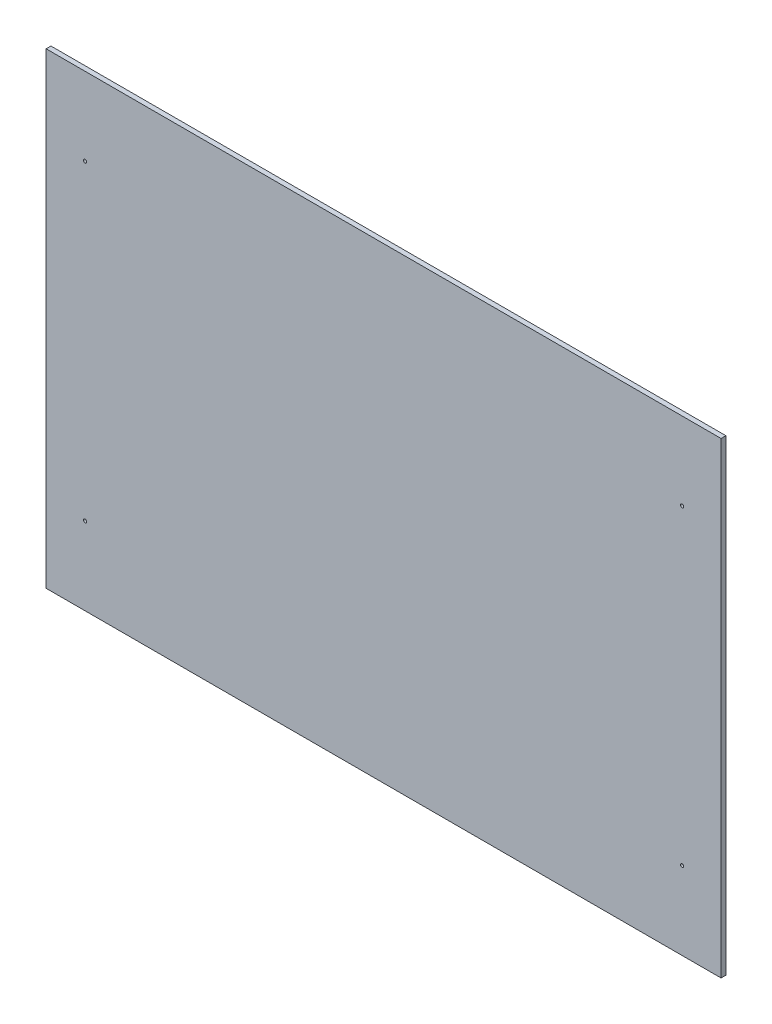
ISO-10303-21;
HEADER;
FILE_DESCRIPTION(('STEP AP214'),'2;1');
FILE_NAME('part.step','',(''),(''),'','','');
FILE_SCHEMA(('AUTOMOTIVE_DESIGN { 1 0 10303 214 1 1 1 1 }'));
ENDSEC;
DATA;
#1=APPLICATION_CONTEXT('core data for automotive mechanical design processes');
#2=APPLICATION_PROTOCOL_DEFINITION('international standard','automotive_design',2000,#1);
#3=PRODUCT_CONTEXT('',#1,'mechanical');
#4=PRODUCT('Part','Part','',(#3));
#5=PRODUCT_RELATED_PRODUCT_CATEGORY('part','',(#4));
#6=PRODUCT_DEFINITION_FORMATION('','',#4);
#7=PRODUCT_DEFINITION_CONTEXT('part definition',#1,'design');
#8=PRODUCT_DEFINITION('design','',#6,#7);
#9=PRODUCT_DEFINITION_SHAPE('','',#8);
#10=(LENGTH_UNIT() NAMED_UNIT(*) SI_UNIT(.MILLI.,.METRE.));
#11=(NAMED_UNIT(*) PLANE_ANGLE_UNIT() SI_UNIT($,.RADIAN.));
#12=(NAMED_UNIT(*) SI_UNIT($,.STERADIAN.) SOLID_ANGLE_UNIT());
#13=UNCERTAINTY_MEASURE_WITH_UNIT(LENGTH_MEASURE(1.E-05),#10,'distance_accuracy_value','');
#14=(GEOMETRIC_REPRESENTATION_CONTEXT(3) GLOBAL_UNCERTAINTY_ASSIGNED_CONTEXT((#13)) GLOBAL_UNIT_ASSIGNED_CONTEXT((#10,
#11,#12)) REPRESENTATION_CONTEXT('',''));
#15=CARTESIAN_POINT('',(0.,0.,0.));
#16=DIRECTION('',(0.,0.,1.));
#17=DIRECTION('',(1.,0.,0.));
#18=AXIS2_PLACEMENT_3D('',#15,#16,#17);
#19=CARTESIAN_POINT('',(0.,0.,0.));
#20=DIRECTION('',(0.,0.,-1.));
#21=DIRECTION('',(-1.,0.,0.));
#22=AXIS2_PLACEMENT_3D('',#19,#20,#21);
#23=PLANE('',#22);
#24=CARTESIAN_POINT('',(19.05,190.5,0.));
#25=DIRECTION('',(0.,0.,1.));
#26=DIRECTION('',(1.,0.,0.));
#27=AXIS2_PLACEMENT_3D('',#24,#25,#26);
#28=CIRCLE('',#27,0.793749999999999);
#29=CARTESIAN_POINT('',(19.84375,190.5,0.));
#30=VERTEX_POINT('',#29);
#31=EDGE_CURVE('E130',#30,#30,#28,.T.);
#32=ORIENTED_EDGE('',*,*,#31,.T.);
#33=EDGE_LOOP('',(#32));
#34=FACE_BOUND('',#33,.T.);
#35=CARTESIAN_POINT('',(311.15,190.5,0.));
#36=DIRECTION('',(0.,0.,1.));
#37=DIRECTION('',(1.,0.,0.));
#38=AXIS2_PLACEMENT_3D('',#35,#36,#37);
#39=CIRCLE('',#38,0.793749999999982);
#40=CARTESIAN_POINT('',(311.94375,190.5,0.));
#41=VERTEX_POINT('',#40);
#42=EDGE_CURVE('E124',#41,#41,#39,.T.);
#43=ORIENTED_EDGE('',*,*,#42,.T.);
#44=EDGE_LOOP('',(#43));
#45=FACE_BOUND('',#44,.T.);
#46=CARTESIAN_POINT('',(19.05,38.1,0.));
#47=DIRECTION('',(0.,0.,1.));
#48=DIRECTION('',(1.,0.,0.));
#49=AXIS2_PLACEMENT_3D('',#46,#47,#48);
#50=CIRCLE('',#49,0.793749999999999);
#51=CARTESIAN_POINT('',(19.84375,38.1,0.));
#52=VERTEX_POINT('',#51);
#53=EDGE_CURVE('E118',#52,#52,#50,.T.);
#54=ORIENTED_EDGE('',*,*,#53,.T.);
#55=EDGE_LOOP('',(#54));
#56=FACE_BOUND('',#55,.T.);
#57=DIRECTION('',(0.,-1.,0.));
#58=VECTOR('',#57,1.);
#59=CARTESIAN_POINT('',(0.,0.,0.));
#60=LINE('',#59,#58);
#61=CARTESIAN_POINT('',(0.,228.6,0.));
#62=VERTEX_POINT('',#61);
#63=CARTESIAN_POINT('',(0.,0.,0.));
#64=VERTEX_POINT('',#63);
#65=EDGE_CURVE('E99',#62,#64,#60,.T.);
#66=ORIENTED_EDGE('',*,*,#65,.F.);
#67=DIRECTION('',(-1.,0.,0.));
#68=VECTOR('',#67,1.);
#69=CARTESIAN_POINT('',(0.,228.6,0.));
#70=LINE('',#69,#68);
#71=CARTESIAN_POINT('',(330.2,228.6,0.));
#72=VERTEX_POINT('',#71);
#73=EDGE_CURVE('E75',#72,#62,#70,.T.);
#74=ORIENTED_EDGE('',*,*,#73,.F.);
#75=DIRECTION('',(0.,1.,0.));
#76=VECTOR('',#75,1.);
#77=CARTESIAN_POINT('',(330.2,0.,0.));
#78=LINE('',#77,#76);
#79=CARTESIAN_POINT('',(330.2,0.,0.));
#80=VERTEX_POINT('',#79);
#81=EDGE_CURVE('E69',#80,#72,#78,.T.);
#82=ORIENTED_EDGE('',*,*,#81,.F.);
#83=DIRECTION('',(1.,0.,0.));
#84=VECTOR('',#83,1.);
#85=CARTESIAN_POINT('',(0.,0.,0.));
#86=LINE('',#85,#84);
#87=EDGE_CURVE('E91',#64,#80,#86,.T.);
#88=ORIENTED_EDGE('',*,*,#87,.F.);
#89=EDGE_LOOP('',(#66,#74,#82,#88));
#90=FACE_BOUND('',#89,.T.);
#91=CARTESIAN_POINT('',(311.15,38.1,0.));
#92=DIRECTION('',(0.,0.,1.));
#93=DIRECTION('',(1.,0.,0.));
#94=AXIS2_PLACEMENT_3D('',#91,#92,#93);
#95=CIRCLE('',#94,0.793749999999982);
#96=CARTESIAN_POINT('',(311.94375,38.1,0.));
#97=VERTEX_POINT('',#96);
#98=EDGE_CURVE('E102',#97,#97,#95,.T.);
#99=ORIENTED_EDGE('',*,*,#98,.T.);
#100=EDGE_LOOP('',(#99));
#101=FACE_BOUND('',#100,.T.);
#102=ADVANCED_FACE('F35',(#34,#45,#56,#90,#101),#23,.T.);
#103=CARTESIAN_POINT('',(0.,0.,2.3622));
#104=DIRECTION('',(1.,0.,0.));
#105=DIRECTION('',(0.,0.,-1.));
#106=AXIS2_PLACEMENT_3D('',#103,#104,#105);
#107=PLANE('',#106);
#108=ORIENTED_EDGE('',*,*,#65,.T.);
#109=DIRECTION('',(0.,0.,-1.));
#110=VECTOR('',#109,1.);
#111=CARTESIAN_POINT('',(0.,0.,2.3622));
#112=LINE('',#111,#110);
#113=CARTESIAN_POINT('',(0.,0.,2.3622));
#114=VERTEX_POINT('',#113);
#115=EDGE_CURVE('E11',#114,#64,#112,.T.);
#116=ORIENTED_EDGE('',*,*,#115,.F.);
#117=DIRECTION('',(0.,-1.,0.));
#118=VECTOR('',#117,1.);
#119=CARTESIAN_POINT('',(0.,0.,2.3622));
#120=LINE('',#119,#118);
#121=CARTESIAN_POINT('',(0.,228.6,2.3622));
#122=VERTEX_POINT('',#121);
#123=EDGE_CURVE('E87',#122,#114,#120,.T.);
#124=ORIENTED_EDGE('',*,*,#123,.F.);
#125=DIRECTION('',(0.,0.,-1.));
#126=VECTOR('',#125,1.);
#127=CARTESIAN_POINT('',(0.,228.6,2.3622));
#128=LINE('',#127,#126);
#129=EDGE_CURVE('E95',#122,#62,#128,.T.);
#130=ORIENTED_EDGE('',*,*,#129,.T.);
#131=EDGE_LOOP('',(#108,#116,#124,#130));
#132=FACE_BOUND('',#131,.T.);
#133=ADVANCED_FACE('F37',(#132),#107,.F.);
#134=CARTESIAN_POINT('',(0.,0.,2.3622));
#135=DIRECTION('',(0.,1.,0.));
#136=DIRECTION('',(0.,0.,1.));
#137=AXIS2_PLACEMENT_3D('',#134,#135,#136);
#138=PLANE('',#137);
#139=ORIENTED_EDGE('',*,*,#87,.T.);
#140=DIRECTION('',(0.,0.,-1.));
#141=VECTOR('',#140,1.);
#142=CARTESIAN_POINT('',(330.2,0.,2.3622));
#143=LINE('',#142,#141);
#144=CARTESIAN_POINT('',(330.2,0.,2.3622));
#145=VERTEX_POINT('',#144);
#146=EDGE_CURVE('E44',#145,#80,#143,.T.);
#147=ORIENTED_EDGE('',*,*,#146,.F.);
#148=DIRECTION('',(1.,0.,0.));
#149=VECTOR('',#148,1.);
#150=CARTESIAN_POINT('',(0.,0.,2.3622));
#151=LINE('',#150,#149);
#152=EDGE_CURVE('E82',#114,#145,#151,.T.);
#153=ORIENTED_EDGE('',*,*,#152,.F.);
#154=ORIENTED_EDGE('',*,*,#115,.T.);
#155=EDGE_LOOP('',(#139,#147,#153,#154));
#156=FACE_BOUND('',#155,.T.);
#157=ADVANCED_FACE('F90',(#156),#138,.F.);
#158=CARTESIAN_POINT('',(330.2,0.,2.3622));
#159=DIRECTION('',(-1.,0.,0.));
#160=DIRECTION('',(0.,0.,1.));
#161=AXIS2_PLACEMENT_3D('',#158,#159,#160);
#162=PLANE('',#161);
#163=ORIENTED_EDGE('',*,*,#81,.T.);
#164=DIRECTION('',(0.,0.,-1.));
#165=VECTOR('',#164,1.);
#166=CARTESIAN_POINT('',(330.2,228.6,2.3622));
#167=LINE('',#166,#165);
#168=CARTESIAN_POINT('',(330.2,228.6,2.3622));
#169=VERTEX_POINT('',#168);
#170=EDGE_CURVE('E92',#169,#72,#167,.T.);
#171=ORIENTED_EDGE('',*,*,#170,.F.);
#172=DIRECTION('',(0.,1.,0.));
#173=VECTOR('',#172,1.);
#174=CARTESIAN_POINT('',(330.2,0.,2.3622));
#175=LINE('',#174,#173);
#176=EDGE_CURVE('E85',#145,#169,#175,.T.);
#177=ORIENTED_EDGE('',*,*,#176,.F.);
#178=ORIENTED_EDGE('',*,*,#146,.T.);
#179=EDGE_LOOP('',(#163,#171,#177,#178));
#180=FACE_BOUND('',#179,.T.);
#181=ADVANCED_FACE('F93',(#180),#162,.F.);
#182=CARTESIAN_POINT('',(0.,228.6,2.3622));
#183=DIRECTION('',(0.,-1.,0.));
#184=DIRECTION('',(0.,0.,-1.));
#185=AXIS2_PLACEMENT_3D('',#182,#183,#184);
#186=PLANE('',#185);
#187=ORIENTED_EDGE('',*,*,#73,.T.);
#188=ORIENTED_EDGE('',*,*,#129,.F.);
#189=DIRECTION('',(-1.,0.,0.));
#190=VECTOR('',#189,1.);
#191=CARTESIAN_POINT('',(0.,228.6,2.3622));
#192=LINE('',#191,#190);
#193=EDGE_CURVE('E52',#169,#122,#192,.T.);
#194=ORIENTED_EDGE('',*,*,#193,.F.);
#195=ORIENTED_EDGE('',*,*,#170,.T.);
#196=EDGE_LOOP('',(#187,#188,#194,#195));
#197=FACE_BOUND('',#196,.T.);
#198=ADVANCED_FACE('F107',(#197),#186,.F.);
#199=CARTESIAN_POINT('',(0.,0.,2.3622));
#200=DIRECTION('',(0.,0.,-1.));
#201=DIRECTION('',(-1.,0.,0.));
#202=AXIS2_PLACEMENT_3D('',#199,#200,#201);
#203=PLANE('',#202);
#204=CARTESIAN_POINT('',(19.05,190.5,2.3622));
#205=DIRECTION('',(0.,0.,1.));
#206=DIRECTION('',(1.,0.,0.));
#207=AXIS2_PLACEMENT_3D('',#204,#205,#206);
#208=CIRCLE('',#207,0.793749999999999);
#209=CARTESIAN_POINT('',(19.84375,190.5,2.3622));
#210=VERTEX_POINT('',#209);
#211=EDGE_CURVE('E133',#210,#210,#208,.T.);
#212=ORIENTED_EDGE('',*,*,#211,.F.);
#213=EDGE_LOOP('',(#212));
#214=FACE_BOUND('',#213,.T.);
#215=CARTESIAN_POINT('',(311.15,190.5,2.3622));
#216=DIRECTION('',(0.,0.,1.));
#217=DIRECTION('',(1.,0.,0.));
#218=AXIS2_PLACEMENT_3D('',#215,#216,#217);
#219=CIRCLE('',#218,0.793749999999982);
#220=CARTESIAN_POINT('',(311.94375,190.5,2.3622));
#221=VERTEX_POINT('',#220);
#222=EDGE_CURVE('E127',#221,#221,#219,.T.);
#223=ORIENTED_EDGE('',*,*,#222,.F.);
#224=EDGE_LOOP('',(#223));
#225=FACE_BOUND('',#224,.T.);
#226=CARTESIAN_POINT('',(19.05,38.1,2.3622));
#227=DIRECTION('',(0.,0.,1.));
#228=DIRECTION('',(1.,0.,0.));
#229=AXIS2_PLACEMENT_3D('',#226,#227,#228);
#230=CIRCLE('',#229,0.793749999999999);
#231=CARTESIAN_POINT('',(19.84375,38.1,2.3622));
#232=VERTEX_POINT('',#231);
#233=EDGE_CURVE('E121',#232,#232,#230,.T.);
#234=ORIENTED_EDGE('',*,*,#233,.F.);
#235=EDGE_LOOP('',(#234));
#236=FACE_BOUND('',#235,.T.);
#237=CARTESIAN_POINT('',(311.15,38.1,2.3622));
#238=DIRECTION('',(0.,0.,1.));
#239=DIRECTION('',(1.,0.,0.));
#240=AXIS2_PLACEMENT_3D('',#237,#238,#239);
#241=CIRCLE('',#240,0.793749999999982);
#242=CARTESIAN_POINT('',(311.94375,38.1,2.3622));
#243=VERTEX_POINT('',#242);
#244=EDGE_CURVE('E115',#243,#243,#241,.T.);
#245=ORIENTED_EDGE('',*,*,#244,.F.);
#246=EDGE_LOOP('',(#245));
#247=FACE_BOUND('',#246,.T.);
#248=ORIENTED_EDGE('',*,*,#123,.T.);
#249=ORIENTED_EDGE('',*,*,#152,.T.);
#250=ORIENTED_EDGE('',*,*,#176,.T.);
#251=ORIENTED_EDGE('',*,*,#193,.T.);
#252=EDGE_LOOP('',(#248,#249,#250,#251));
#253=FACE_BOUND('',#252,.T.);
#254=ADVANCED_FACE('F83',(#214,#225,#236,#247,#253),#203,.F.);
#255=CARTESIAN_POINT('',(311.15,38.1,2.3622));
#256=DIRECTION('',(0.,0.,1.));
#257=DIRECTION('',(1.,0.,0.));
#258=AXIS2_PLACEMENT_3D('',#255,#256,#257);
#259=CYLINDRICAL_SURFACE('',#258,0.793749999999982);
#260=ORIENTED_EDGE('',*,*,#98,.F.);
#261=EDGE_LOOP('',(#260));
#262=FACE_BOUND('',#261,.T.);
#263=ORIENTED_EDGE('',*,*,#244,.T.);
#264=EDGE_LOOP('',(#263));
#265=FACE_BOUND('',#264,.T.);
#266=ADVANCED_FACE('F141',(#262,#265),#259,.F.);
#267=CARTESIAN_POINT('',(19.05,38.1,2.3622));
#268=DIRECTION('',(0.,0.,1.));
#269=DIRECTION('',(1.,0.,0.));
#270=AXIS2_PLACEMENT_3D('',#267,#268,#269);
#271=CYLINDRICAL_SURFACE('',#270,0.793749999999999);
#272=ORIENTED_EDGE('',*,*,#53,.F.);
#273=EDGE_LOOP('',(#272));
#274=FACE_BOUND('',#273,.T.);
#275=ORIENTED_EDGE('',*,*,#233,.T.);
#276=EDGE_LOOP('',(#275));
#277=FACE_BOUND('',#276,.T.);
#278=ADVANCED_FACE('F150',(#274,#277),#271,.F.);
#279=CARTESIAN_POINT('',(311.15,190.5,2.3622));
#280=DIRECTION('',(0.,0.,1.));
#281=DIRECTION('',(1.,0.,0.));
#282=AXIS2_PLACEMENT_3D('',#279,#280,#281);
#283=CYLINDRICAL_SURFACE('',#282,0.793749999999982);
#284=ORIENTED_EDGE('',*,*,#42,.F.);
#285=EDGE_LOOP('',(#284));
#286=FACE_BOUND('',#285,.T.);
#287=ORIENTED_EDGE('',*,*,#222,.T.);
#288=EDGE_LOOP('',(#287));
#289=FACE_BOUND('',#288,.T.);
#290=ADVANCED_FACE('F156',(#286,#289),#283,.F.);
#291=CARTESIAN_POINT('',(19.05,190.5,2.3622));
#292=DIRECTION('',(0.,0.,1.));
#293=DIRECTION('',(1.,0.,0.));
#294=AXIS2_PLACEMENT_3D('',#291,#292,#293);
#295=CYLINDRICAL_SURFACE('',#294,0.793749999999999);
#296=ORIENTED_EDGE('',*,*,#31,.F.);
#297=EDGE_LOOP('',(#296));
#298=FACE_BOUND('',#297,.T.);
#299=ORIENTED_EDGE('',*,*,#211,.T.);
#300=EDGE_LOOP('',(#299));
#301=FACE_BOUND('',#300,.T.);
#302=ADVANCED_FACE('F137',(#298,#301),#295,.F.);
#303=CLOSED_SHELL('',(#102,#133,#157,#181,#198,#254,#266,#278,#290,#302));
#304=MANIFOLD_SOLID_BREP('B2',#303);
#305=ADVANCED_BREP_SHAPE_REPRESENTATION('',(#18,#304),#14);
#306=SHAPE_DEFINITION_REPRESENTATION(#9,#305);
ENDSEC;
END-ISO-10303-21;
